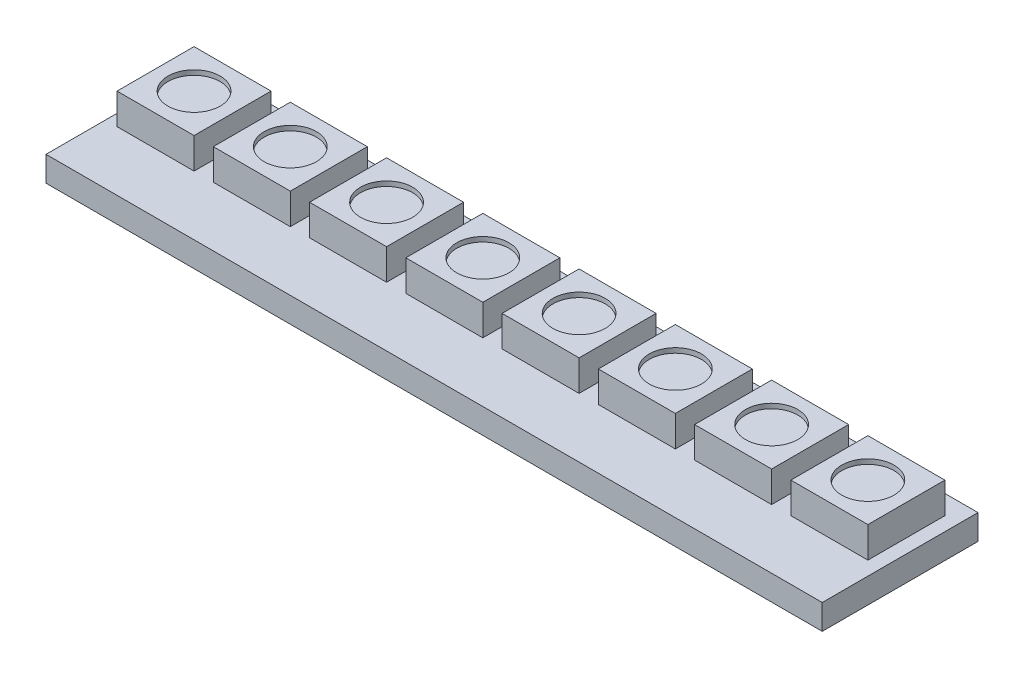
from build123d import *

# Parameters (mm, degrees)
SKETCH1_W           = 51.2064
SKETCH1_H           = 10.2743
BOSS_EXTRUDE1_DEPTH = 1.651
SKETCH2_W           = 5.08
SKETCH2_H           = 5.08
BOSS_EXTRUDE2_DEPTH = 2.032
SKETCH3_R           = 1.721817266
CUT_EXTRUDE1_DEPTH  = 0.3175
LPATTERN1_COUNT     = 8
LPATTERN1_PITCH     = 6.35


with BuildPart() as part:
    # Sketch1 → Boss-Extrude1 (new body)
    with BuildSketch(Plane(origin=(0, 0, 0), x_dir=(1, 0, 0), z_dir=(0, 1, 0))):
        Rectangle(SKETCH1_W, SKETCH1_H)
    extrude(amount=BOSS_EXTRUDE1_DEPTH)

    # Sketch2 → Boss-Extrude2 (add)
    with BuildSketch(Plane(origin=(0, 1.651, 0), x_dir=(1, 0, 0), z_dir=(0, 1, 0))):
        with Locations((-22.3012, 1.32715)):
            Rectangle(SKETCH2_W, SKETCH2_H)
    boss_extrude2 = extrude(amount=BOSS_EXTRUDE2_DEPTH)

    # Sketch3 → Cut-Extrude1 (cut)
    with BuildSketch(Plane(origin=(0, 3.683, 0), x_dir=(1, 0, 0), z_dir=(0, 1, 0))):
        with Locations(Location((-22.3012, 1.32715, 0), (0, 0, 270))):
            Circle(SKETCH3_R)
    cut_extrude1 = extrude(amount=-CUT_EXTRUDE1_DEPTH, mode=Mode.SUBTRACT)

    # LPattern1: Boss-Extrude2, Cut-Extrude1 ×8
    with Locations(*[(i * LPATTERN1_PITCH, 0, 0) for i in range(1, LPATTERN1_COUNT)]):
        add(boss_extrude2)
        add(cut_extrude1, mode=Mode.SUBTRACT)


solid = part.part
